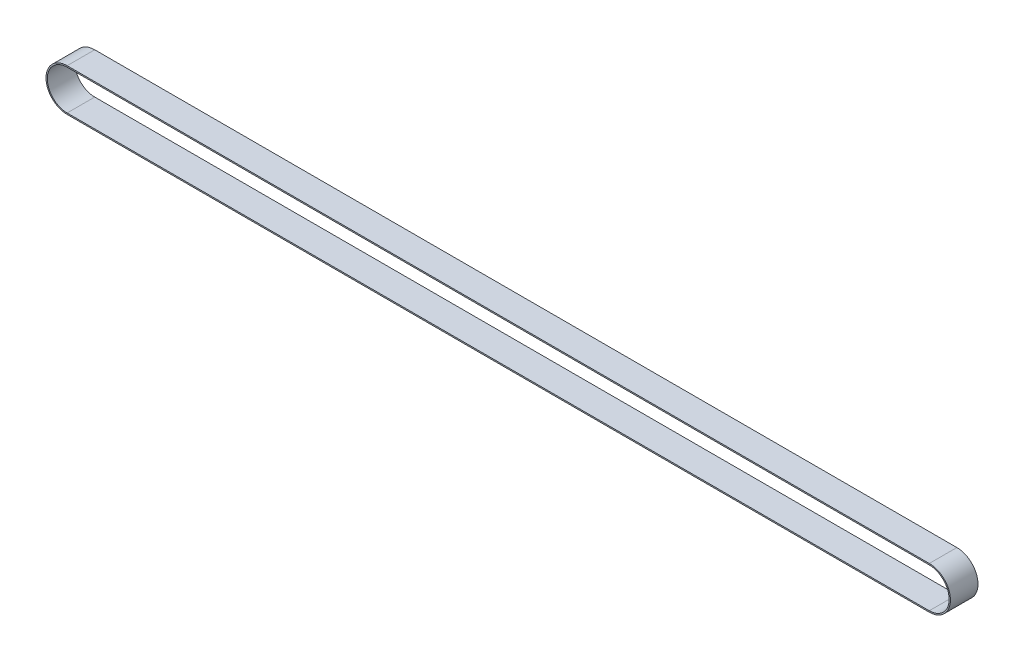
ISO-10303-21;
HEADER;
FILE_DESCRIPTION(('STEP AP214'),'2;1');
FILE_NAME('part.step','',(''),(''),'','','');
FILE_SCHEMA(('AUTOMOTIVE_DESIGN { 1 0 10303 214 1 1 1 1 }'));
ENDSEC;
DATA;
#1=APPLICATION_CONTEXT('core data for automotive mechanical design processes');
#2=APPLICATION_PROTOCOL_DEFINITION('international standard','automotive_design',2000,#1);
#3=PRODUCT_CONTEXT('',#1,'mechanical');
#4=PRODUCT('Part','Part','',(#3));
#5=PRODUCT_RELATED_PRODUCT_CATEGORY('part','',(#4));
#6=PRODUCT_DEFINITION_FORMATION('','',#4);
#7=PRODUCT_DEFINITION_CONTEXT('part definition',#1,'design');
#8=PRODUCT_DEFINITION('design','',#6,#7);
#9=PRODUCT_DEFINITION_SHAPE('','',#8);
#10=(LENGTH_UNIT() NAMED_UNIT(*) SI_UNIT(.MILLI.,.METRE.));
#11=(NAMED_UNIT(*) PLANE_ANGLE_UNIT() SI_UNIT($,.RADIAN.));
#12=(NAMED_UNIT(*) SI_UNIT($,.STERADIAN.) SOLID_ANGLE_UNIT());
#13=UNCERTAINTY_MEASURE_WITH_UNIT(LENGTH_MEASURE(1.E-05),#10,'distance_accuracy_value','');
#14=(GEOMETRIC_REPRESENTATION_CONTEXT(3) GLOBAL_UNCERTAINTY_ASSIGNED_CONTEXT((#13)) GLOBAL_UNIT_ASSIGNED_CONTEXT((#10,
#11,#12)) REPRESENTATION_CONTEXT('',''));
#15=CARTESIAN_POINT('',(0.,0.,0.));
#16=DIRECTION('',(0.,0.,1.));
#17=DIRECTION('',(1.,0.,0.));
#18=AXIS2_PLACEMENT_3D('',#15,#16,#17);
#19=CARTESIAN_POINT('',(1022.,147.999999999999,16.));
#20=DIRECTION('',(0.,0.,-1.));
#21=DIRECTION('',(-1.,0.,0.));
#22=AXIS2_PLACEMENT_3D('',#19,#20,#21);
#23=PLANE('',#22);
#24=CARTESIAN_POINT('',(1022.,147.999999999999,16.));
#25=DIRECTION('',(0.,0.,-1.));
#26=DIRECTION('',(-1.,0.,0.));
#27=AXIS2_PLACEMENT_3D('',#24,#25,#26);
#28=CIRCLE('',#27,24.5);
#29=CARTESIAN_POINT('',(1022.,123.499999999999,16.));
#30=VERTEX_POINT('',#29);
#31=CARTESIAN_POINT('',(1022.,172.499999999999,16.));
#32=VERTEX_POINT('',#31);
#33=EDGE_CURVE('E166',#30,#32,#28,.F.);
#34=ORIENTED_EDGE('',*,*,#33,.T.);
#35=DIRECTION('',(-1.,0.,0.));
#36=VECTOR('',#35,1.);
#37=CARTESIAN_POINT('',(1022.,172.499999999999,16.));
#38=LINE('',#37,#36);
#39=CARTESIAN_POINT('',(22.0000000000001,172.5,16.));
#40=VERTEX_POINT('',#39);
#41=EDGE_CURVE('E169',#32,#40,#38,.T.);
#42=ORIENTED_EDGE('',*,*,#41,.T.);
#43=CARTESIAN_POINT('',(22.0000000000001,148.,16.));
#44=DIRECTION('',(0.,0.,-1.));
#45=DIRECTION('',(-1.,0.,0.));
#46=AXIS2_PLACEMENT_3D('',#43,#44,#45);
#47=CIRCLE('',#46,24.5);
#48=CARTESIAN_POINT('',(22.0000000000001,123.5,16.));
#49=VERTEX_POINT('',#48);
#50=EDGE_CURVE('E172',#40,#49,#47,.F.);
#51=ORIENTED_EDGE('',*,*,#50,.T.);
#52=DIRECTION('',(1.,0.,0.));
#53=VECTOR('',#52,1.);
#54=CARTESIAN_POINT('',(1022.,123.499999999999,16.));
#55=LINE('',#54,#53);
#56=EDGE_CURVE('E174',#49,#30,#55,.T.);
#57=ORIENTED_EDGE('',*,*,#56,.T.);
#58=EDGE_LOOP('',(#34,#42,#51,#57));
#59=FACE_BOUND('',#58,.T.);
#60=CARTESIAN_POINT('',(1022.,147.999999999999,16.));
#61=DIRECTION('',(0.,0.,1.));
#62=DIRECTION('',(-1.,0.,0.));
#63=AXIS2_PLACEMENT_3D('',#60,#61,#62);
#64=CIRCLE('',#63,23.);
#65=CARTESIAN_POINT('',(1022.,124.999999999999,16.));
#66=VERTEX_POINT('',#65);
#67=CARTESIAN_POINT('',(1022.,170.999999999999,16.));
#68=VERTEX_POINT('',#67);
#69=EDGE_CURVE('E130',#66,#68,#64,.T.);
#70=ORIENTED_EDGE('',*,*,#69,.F.);
#71=DIRECTION('',(1.,0.,0.));
#72=VECTOR('',#71,1.);
#73=CARTESIAN_POINT('',(1022.,124.999999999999,16.));
#74=LINE('',#73,#72);
#75=CARTESIAN_POINT('',(22.0000000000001,125.,16.));
#76=VERTEX_POINT('',#75);
#77=EDGE_CURVE('E152',#76,#66,#74,.T.);
#78=ORIENTED_EDGE('',*,*,#77,.F.);
#79=CARTESIAN_POINT('',(22.0000000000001,148.,16.));
#80=DIRECTION('',(0.,0.,1.));
#81=DIRECTION('',(-1.,0.,0.));
#82=AXIS2_PLACEMENT_3D('',#79,#80,#81);
#83=CIRCLE('',#82,23.);
#84=CARTESIAN_POINT('',(22.0000000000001,171.,16.));
#85=VERTEX_POINT('',#84);
#86=EDGE_CURVE('E150',#85,#76,#83,.T.);
#87=ORIENTED_EDGE('',*,*,#86,.F.);
#88=DIRECTION('',(-1.,0.,0.));
#89=VECTOR('',#88,1.);
#90=CARTESIAN_POINT('',(22.0000000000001,171.,16.));
#91=LINE('',#90,#89);
#92=EDGE_CURVE('E138',#68,#85,#91,.T.);
#93=ORIENTED_EDGE('',*,*,#92,.F.);
#94=EDGE_LOOP('',(#70,#78,#87,#93));
#95=FACE_BOUND('',#94,.T.);
#96=ADVANCED_FACE('F65',(#59,#95),#23,.F.);
#97=CARTESIAN_POINT('',(1022.,147.999999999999,-16.));
#98=DIRECTION('',(0.,0.,-1.));
#99=DIRECTION('',(-1.,0.,0.));
#100=AXIS2_PLACEMENT_3D('',#97,#98,#99);
#101=PLANE('',#100);
#102=CARTESIAN_POINT('',(1022.,147.999999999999,-16.));
#103=DIRECTION('',(0.,0.,-1.));
#104=DIRECTION('',(-1.,0.,0.));
#105=AXIS2_PLACEMENT_3D('',#102,#103,#104);
#106=CIRCLE('',#105,24.5);
#107=CARTESIAN_POINT('',(1022.,123.499999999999,-16.));
#108=VERTEX_POINT('',#107);
#109=CARTESIAN_POINT('',(1022.,172.499999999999,-16.));
#110=VERTEX_POINT('',#109);
#111=EDGE_CURVE('E146',#108,#110,#106,.F.);
#112=ORIENTED_EDGE('',*,*,#111,.F.);
#113=DIRECTION('',(1.,0.,0.));
#114=VECTOR('',#113,1.);
#115=CARTESIAN_POINT('',(1022.,123.499999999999,-16.));
#116=LINE('',#115,#114);
#117=CARTESIAN_POINT('',(22.0000000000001,123.5,-16.));
#118=VERTEX_POINT('',#117);
#119=EDGE_CURVE('E170',#118,#108,#116,.T.);
#120=ORIENTED_EDGE('',*,*,#119,.F.);
#121=CARTESIAN_POINT('',(22.0000000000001,148.,-16.));
#122=DIRECTION('',(0.,0.,-1.));
#123=DIRECTION('',(-1.,0.,0.));
#124=AXIS2_PLACEMENT_3D('',#121,#122,#123);
#125=CIRCLE('',#124,24.5);
#126=CARTESIAN_POINT('',(22.0000000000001,172.5,-16.));
#127=VERTEX_POINT('',#126);
#128=EDGE_CURVE('E181',#127,#118,#125,.F.);
#129=ORIENTED_EDGE('',*,*,#128,.F.);
#130=DIRECTION('',(-1.,0.,0.));
#131=VECTOR('',#130,1.);
#132=CARTESIAN_POINT('',(1022.,172.499999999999,-16.));
#133=LINE('',#132,#131);
#134=EDGE_CURVE('E179',#110,#127,#133,.T.);
#135=ORIENTED_EDGE('',*,*,#134,.F.);
#136=EDGE_LOOP('',(#112,#120,#129,#135));
#137=FACE_BOUND('',#136,.T.);
#138=DIRECTION('',(1.,0.,0.));
#139=VECTOR('',#138,1.);
#140=CARTESIAN_POINT('',(1022.,124.999999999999,-16.));
#141=LINE('',#140,#139);
#142=CARTESIAN_POINT('',(22.0000000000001,125.,-16.));
#143=VERTEX_POINT('',#142);
#144=CARTESIAN_POINT('',(1022.,124.999999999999,-16.));
#145=VERTEX_POINT('',#144);
#146=EDGE_CURVE('E139',#143,#145,#141,.T.);
#147=ORIENTED_EDGE('',*,*,#146,.T.);
#148=CARTESIAN_POINT('',(1022.,147.999999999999,-16.));
#149=DIRECTION('',(0.,0.,1.));
#150=DIRECTION('',(-1.,0.,0.));
#151=AXIS2_PLACEMENT_3D('',#148,#149,#150);
#152=CIRCLE('',#151,23.);
#153=CARTESIAN_POINT('',(1022.,170.999999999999,-16.));
#154=VERTEX_POINT('',#153);
#155=EDGE_CURVE('E88',#145,#154,#152,.T.);
#156=ORIENTED_EDGE('',*,*,#155,.T.);
#157=DIRECTION('',(-1.,0.,0.));
#158=VECTOR('',#157,1.);
#159=CARTESIAN_POINT('',(22.0000000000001,171.,-16.));
#160=LINE('',#159,#158);
#161=CARTESIAN_POINT('',(22.0000000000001,171.,-16.));
#162=VERTEX_POINT('',#161);
#163=EDGE_CURVE('E145',#154,#162,#160,.T.);
#164=ORIENTED_EDGE('',*,*,#163,.T.);
#165=CARTESIAN_POINT('',(22.0000000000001,148.,-16.));
#166=DIRECTION('',(0.,0.,1.));
#167=DIRECTION('',(-1.,0.,0.));
#168=AXIS2_PLACEMENT_3D('',#165,#166,#167);
#169=CIRCLE('',#168,23.);
#170=EDGE_CURVE('E158',#162,#143,#169,.T.);
#171=ORIENTED_EDGE('',*,*,#170,.T.);
#172=EDGE_LOOP('',(#147,#156,#164,#171));
#173=FACE_BOUND('',#172,.T.);
#174=ADVANCED_FACE('F199',(#137,#173),#101,.T.);
#175=CARTESIAN_POINT('',(1022.,147.999999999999,16.));
#176=DIRECTION('',(0.,0.,-1.));
#177=DIRECTION('',(-1.,0.,0.));
#178=AXIS2_PLACEMENT_3D('',#175,#176,#177);
#179=CYLINDRICAL_SURFACE('',#178,24.5);
#180=ORIENTED_EDGE('',*,*,#111,.T.);
#181=DIRECTION('',(0.,0.,-1.));
#182=VECTOR('',#181,1.);
#183=CARTESIAN_POINT('',(1022.,172.499999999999,16.));
#184=LINE('',#183,#182);
#185=EDGE_CURVE('E12',#32,#110,#184,.T.);
#186=ORIENTED_EDGE('',*,*,#185,.F.);
#187=ORIENTED_EDGE('',*,*,#33,.F.);
#188=DIRECTION('',(0.,0.,-1.));
#189=VECTOR('',#188,1.);
#190=CARTESIAN_POINT('',(1022.,123.499999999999,16.));
#191=LINE('',#190,#189);
#192=EDGE_CURVE('E176',#30,#108,#191,.T.);
#193=ORIENTED_EDGE('',*,*,#192,.T.);
#194=EDGE_LOOP('',(#180,#186,#187,#193));
#195=FACE_BOUND('',#194,.T.);
#196=ADVANCED_FACE('F67',(#195),#179,.T.);
#197=CARTESIAN_POINT('',(1022.,172.499999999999,16.));
#198=DIRECTION('',(0.,-1.,0.));
#199=DIRECTION('',(1.,0.,0.));
#200=AXIS2_PLACEMENT_3D('',#197,#198,#199);
#201=PLANE('',#200);
#202=ORIENTED_EDGE('',*,*,#134,.T.);
#203=DIRECTION('',(0.,0.,-1.));
#204=VECTOR('',#203,1.);
#205=CARTESIAN_POINT('',(22.0000000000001,172.5,16.));
#206=LINE('',#205,#204);
#207=EDGE_CURVE('E73',#40,#127,#206,.T.);
#208=ORIENTED_EDGE('',*,*,#207,.F.);
#209=ORIENTED_EDGE('',*,*,#41,.F.);
#210=ORIENTED_EDGE('',*,*,#185,.T.);
#211=EDGE_LOOP('',(#202,#208,#209,#210));
#212=FACE_BOUND('',#211,.T.);
#213=ADVANCED_FACE('F209',(#212),#201,.F.);
#214=CARTESIAN_POINT('',(22.0000000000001,148.,16.));
#215=DIRECTION('',(0.,0.,-1.));
#216=DIRECTION('',(-1.,0.,0.));
#217=AXIS2_PLACEMENT_3D('',#214,#215,#216);
#218=CYLINDRICAL_SURFACE('',#217,24.5);
#219=ORIENTED_EDGE('',*,*,#128,.T.);
#220=DIRECTION('',(0.,0.,-1.));
#221=VECTOR('',#220,1.);
#222=CARTESIAN_POINT('',(22.0000000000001,123.5,16.));
#223=LINE('',#222,#221);
#224=EDGE_CURVE('E186',#49,#118,#223,.T.);
#225=ORIENTED_EDGE('',*,*,#224,.F.);
#226=ORIENTED_EDGE('',*,*,#50,.F.);
#227=ORIENTED_EDGE('',*,*,#207,.T.);
#228=EDGE_LOOP('',(#219,#225,#226,#227));
#229=FACE_BOUND('',#228,.T.);
#230=ADVANCED_FACE('F193',(#229),#218,.T.);
#231=CARTESIAN_POINT('',(1022.,123.499999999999,16.));
#232=DIRECTION('',(0.,1.,0.));
#233=DIRECTION('',(-1.,0.,0.));
#234=AXIS2_PLACEMENT_3D('',#231,#232,#233);
#235=PLANE('',#234);
#236=ORIENTED_EDGE('',*,*,#119,.T.);
#237=ORIENTED_EDGE('',*,*,#192,.F.);
#238=ORIENTED_EDGE('',*,*,#56,.F.);
#239=ORIENTED_EDGE('',*,*,#224,.T.);
#240=EDGE_LOOP('',(#236,#237,#238,#239));
#241=FACE_BOUND('',#240,.T.);
#242=ADVANCED_FACE('F203',(#241),#235,.F.);
#243=CARTESIAN_POINT('',(1022.,147.999999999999,16.));
#244=DIRECTION('',(0.,0.,-1.));
#245=DIRECTION('',(-1.,0.,0.));
#246=AXIS2_PLACEMENT_3D('',#243,#244,#245);
#247=CYLINDRICAL_SURFACE('',#246,23.);
#248=ORIENTED_EDGE('',*,*,#155,.F.);
#249=DIRECTION('',(0.,0.,-1.));
#250=VECTOR('',#249,1.);
#251=CARTESIAN_POINT('',(1022.,124.999999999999,16.));
#252=LINE('',#251,#250);
#253=EDGE_CURVE('E134',#66,#145,#252,.T.);
#254=ORIENTED_EDGE('',*,*,#253,.F.);
#255=ORIENTED_EDGE('',*,*,#69,.T.);
#256=DIRECTION('',(0.,0.,-1.));
#257=VECTOR('',#256,1.);
#258=CARTESIAN_POINT('',(1022.,170.999999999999,16.));
#259=LINE('',#258,#257);
#260=EDGE_CURVE('E133',#68,#154,#259,.T.);
#261=ORIENTED_EDGE('',*,*,#260,.T.);
#262=EDGE_LOOP('',(#248,#254,#255,#261));
#263=FACE_BOUND('',#262,.T.);
#264=ADVANCED_FACE('F132',(#263),#247,.F.);
#265=CARTESIAN_POINT('',(22.0000000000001,171.,16.));
#266=DIRECTION('',(0.,-1.,0.));
#267=DIRECTION('',(1.,0.,0.));
#268=AXIS2_PLACEMENT_3D('',#265,#266,#267);
#269=PLANE('',#268);
#270=ORIENTED_EDGE('',*,*,#163,.F.);
#271=ORIENTED_EDGE('',*,*,#260,.F.);
#272=ORIENTED_EDGE('',*,*,#92,.T.);
#273=DIRECTION('',(0.,0.,-1.));
#274=VECTOR('',#273,1.);
#275=CARTESIAN_POINT('',(22.0000000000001,171.,16.));
#276=LINE('',#275,#274);
#277=EDGE_CURVE('E147',#85,#162,#276,.T.);
#278=ORIENTED_EDGE('',*,*,#277,.T.);
#279=EDGE_LOOP('',(#270,#271,#272,#278));
#280=FACE_BOUND('',#279,.T.);
#281=ADVANCED_FACE('F142',(#280),#269,.T.);
#282=CARTESIAN_POINT('',(22.0000000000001,148.,16.));
#283=DIRECTION('',(0.,0.,-1.));
#284=DIRECTION('',(-1.,0.,0.));
#285=AXIS2_PLACEMENT_3D('',#282,#283,#284);
#286=CYLINDRICAL_SURFACE('',#285,23.);
#287=ORIENTED_EDGE('',*,*,#170,.F.);
#288=ORIENTED_EDGE('',*,*,#277,.F.);
#289=ORIENTED_EDGE('',*,*,#86,.T.);
#290=DIRECTION('',(0.,0.,-1.));
#291=VECTOR('',#290,1.);
#292=CARTESIAN_POINT('',(22.0000000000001,125.,16.));
#293=LINE('',#292,#291);
#294=EDGE_CURVE('E80',#76,#143,#293,.T.);
#295=ORIENTED_EDGE('',*,*,#294,.T.);
#296=EDGE_LOOP('',(#287,#288,#289,#295));
#297=FACE_BOUND('',#296,.T.);
#298=ADVANCED_FACE('F232',(#297),#286,.F.);
#299=CARTESIAN_POINT('',(1022.,124.999999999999,16.));
#300=DIRECTION('',(0.,1.,0.));
#301=DIRECTION('',(-1.,0.,0.));
#302=AXIS2_PLACEMENT_3D('',#299,#300,#301);
#303=PLANE('',#302);
#304=ORIENTED_EDGE('',*,*,#146,.F.);
#305=ORIENTED_EDGE('',*,*,#294,.F.);
#306=ORIENTED_EDGE('',*,*,#77,.T.);
#307=ORIENTED_EDGE('',*,*,#253,.T.);
#308=EDGE_LOOP('',(#304,#305,#306,#307));
#309=FACE_BOUND('',#308,.T.);
#310=ADVANCED_FACE('F236',(#309),#303,.T.);
#311=CLOSED_SHELL('',(#96,#174,#196,#213,#230,#242,#264,#281,#298,#310));
#312=MANIFOLD_SOLID_BREP('B2',#311);
#313=ADVANCED_BREP_SHAPE_REPRESENTATION('',(#18,#312),#14);
#314=SHAPE_DEFINITION_REPRESENTATION(#9,#313);
ENDSEC;
END-ISO-10303-21;
